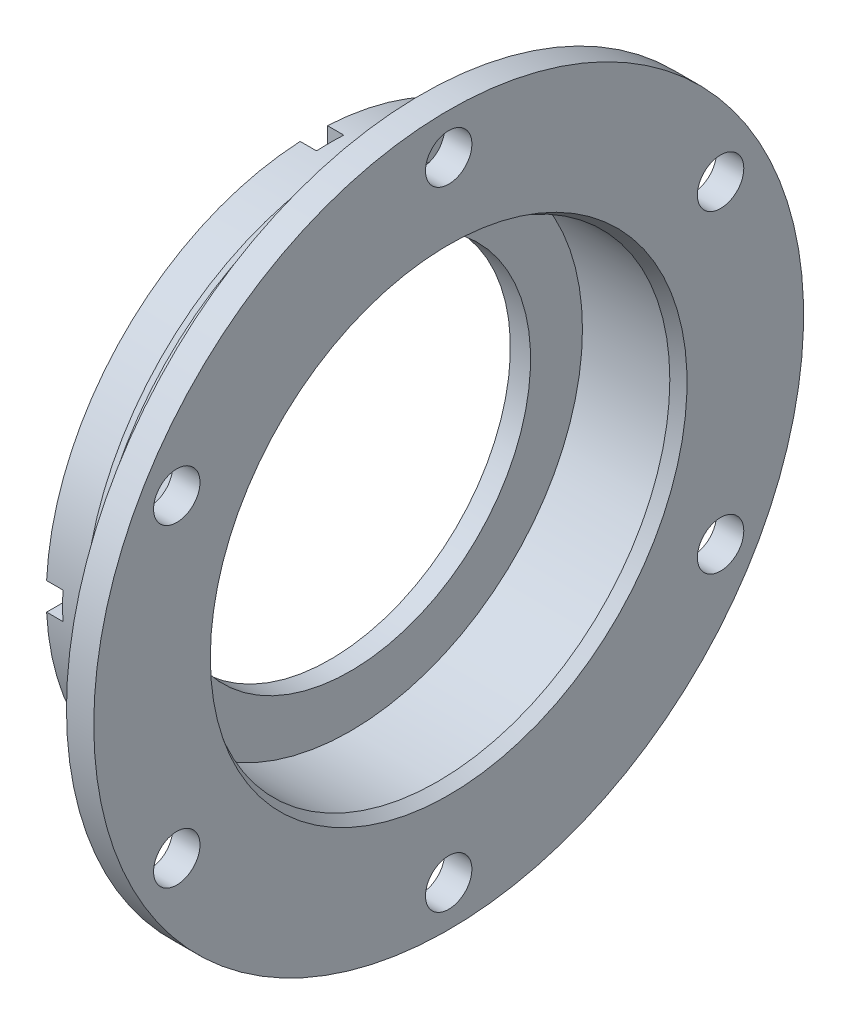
ISO-10303-21;
HEADER;
FILE_DESCRIPTION(('STEP AP214'),'2;1');
FILE_NAME('part.step','',(''),(''),'','','');
FILE_SCHEMA(('AUTOMOTIVE_DESIGN { 1 0 10303 214 1 1 1 1 }'));
ENDSEC;
DATA;
#1=APPLICATION_CONTEXT('core data for automotive mechanical design processes');
#2=APPLICATION_PROTOCOL_DEFINITION('international standard','automotive_design',2000,#1);
#3=PRODUCT_CONTEXT('',#1,'mechanical');
#4=PRODUCT('Part','Part','',(#3));
#5=PRODUCT_RELATED_PRODUCT_CATEGORY('part','',(#4));
#6=PRODUCT_DEFINITION_FORMATION('','',#4);
#7=PRODUCT_DEFINITION_CONTEXT('part definition',#1,'design');
#8=PRODUCT_DEFINITION('design','',#6,#7);
#9=PRODUCT_DEFINITION_SHAPE('','',#8);
#10=(LENGTH_UNIT() NAMED_UNIT(*) SI_UNIT(.MILLI.,.METRE.));
#11=(NAMED_UNIT(*) PLANE_ANGLE_UNIT() SI_UNIT($,.RADIAN.));
#12=(NAMED_UNIT(*) SI_UNIT($,.STERADIAN.) SOLID_ANGLE_UNIT());
#13=UNCERTAINTY_MEASURE_WITH_UNIT(LENGTH_MEASURE(1.E-05),#10,'distance_accuracy_value','');
#14=(GEOMETRIC_REPRESENTATION_CONTEXT(3) GLOBAL_UNCERTAINTY_ASSIGNED_CONTEXT((#13)) GLOBAL_UNIT_ASSIGNED_CONTEXT((#10,
#11,#12)) REPRESENTATION_CONTEXT('',''));
#15=CARTESIAN_POINT('',(0.,0.,0.));
#16=DIRECTION('',(0.,0.,1.));
#17=DIRECTION('',(1.,0.,0.));
#18=AXIS2_PLACEMENT_3D('',#15,#16,#17);
#19=CARTESIAN_POINT('',(-14.8847324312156,0.,0.));
#20=DIRECTION('',(-1.,0.,0.));
#21=DIRECTION('',(0.,0.,1.));
#22=AXIS2_PLACEMENT_3D('',#19,#20,#21);
#23=CYLINDRICAL_SURFACE('',#22,50.);
#24=CARTESIAN_POINT('',(8.7,0.,0.));
#25=DIRECTION('',(-1.,0.,0.));
#26=DIRECTION('',(0.,0.,1.));
#27=AXIS2_PLACEMENT_3D('',#24,#25,#26);
#28=CIRCLE('',#27,50.);
#29=CARTESIAN_POINT('',(8.7,0.,50.));
#30=VERTEX_POINT('',#29);
#31=EDGE_CURVE('E848',#30,#30,#28,.T.);
#32=ORIENTED_EDGE('',*,*,#31,.F.);
#33=EDGE_LOOP('',(#32));
#34=FACE_BOUND('',#33,.T.);
#35=CARTESIAN_POINT('',(10.6,0.,0.));
#36=DIRECTION('',(-1.,0.,0.));
#37=DIRECTION('',(0.,0.,1.));
#38=AXIS2_PLACEMENT_3D('',#35,#36,#37);
#39=CIRCLE('',#38,50.);
#40=CARTESIAN_POINT('',(10.6,0.,50.));
#41=VERTEX_POINT('',#40);
#42=EDGE_CURVE('E722',#41,#41,#39,.T.);
#43=ORIENTED_EDGE('',*,*,#42,.T.);
#44=EDGE_LOOP('',(#43));
#45=FACE_BOUND('',#44,.T.);
#46=ADVANCED_FACE('F453',(#34,#45),#23,.T.);
#47=CARTESIAN_POINT('',(19.7,0.,0.));
#48=DIRECTION('',(-1.,0.,0.));
#49=DIRECTION('',(0.,0.,1.));
#50=AXIS2_PLACEMENT_3D('',#47,#48,#49);
#51=CIRCLE('',#50,50.);
#52=CARTESIAN_POINT('',(19.7,0.,50.));
#53=VERTEX_POINT('',#52);
#54=EDGE_CURVE('E845',#53,#53,#51,.T.);
#55=ORIENTED_EDGE('',*,*,#54,.T.);
#56=EDGE_LOOP('',(#55));
#57=FACE_BOUND('',#56,.T.);
#58=CARTESIAN_POINT('',(17.7,0.,0.));
#59=DIRECTION('',(-1.,0.,0.));
#60=DIRECTION('',(0.,0.,1.));
#61=AXIS2_PLACEMENT_3D('',#58,#59,#60);
#62=CIRCLE('',#61,50.);
#63=CARTESIAN_POINT('',(17.7,0.,50.));
#64=VERTEX_POINT('',#63);
#65=EDGE_CURVE('E719',#64,#64,#62,.T.);
#66=ORIENTED_EDGE('',*,*,#65,.F.);
#67=EDGE_LOOP('',(#66));
#68=FACE_BOUND('',#67,.T.);
#69=ADVANCED_FACE('F743',(#57,#68),#23,.T.);
#70=CARTESIAN_POINT('',(-14.8847324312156,0.,0.));
#71=DIRECTION('',(-1.,0.,0.));
#72=DIRECTION('',(0.,0.,1.));
#73=AXIS2_PLACEMENT_3D('',#70,#71,#72);
#74=CYLINDRICAL_SURFACE('',#73,45.);
#75=CARTESIAN_POINT('',(0.,0.,0.));
#76=DIRECTION('',(-1.,0.,0.));
#77=DIRECTION('',(0.,0.,1.));
#78=AXIS2_PLACEMENT_3D('',#75,#76,#77);
#79=CIRCLE('',#78,45.);
#80=CARTESIAN_POINT('',(0.,44.9305018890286,-2.5));
#81=VERTEX_POINT('',#80);
#82=CARTESIAN_POINT('',(0.,2.50000000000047,-44.9305018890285));
#83=VERTEX_POINT('',#82);
#84=EDGE_CURVE('E583',#81,#83,#79,.T.);
#85=ORIENTED_EDGE('',*,*,#84,.T.);
#86=DIRECTION('',(-1.,0.,0.));
#87=VECTOR('',#86,1.);
#88=CARTESIAN_POINT('',(9.44676778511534,2.50000000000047,-44.9305018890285));
#89=LINE('',#88,#87);
#90=CARTESIAN_POINT('',(3.,2.50000000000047,-44.9305018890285));
#91=VERTEX_POINT('',#90);
#92=EDGE_CURVE('E569',#91,#83,#89,.T.);
#93=ORIENTED_EDGE('',*,*,#92,.F.);
#94=CARTESIAN_POINT('',(3.,0.,0.));
#95=DIRECTION('',(-1.,0.,0.));
#96=DIRECTION('',(0.,0.,1.));
#97=AXIS2_PLACEMENT_3D('',#94,#95,#96);
#98=CIRCLE('',#97,45.);
#99=CARTESIAN_POINT('',(3.,44.9305018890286,-2.5));
#100=VERTEX_POINT('',#99);
#101=EDGE_CURVE('E581',#100,#91,#98,.T.);
#102=ORIENTED_EDGE('',*,*,#101,.F.);
#103=DIRECTION('',(-1.,0.,0.));
#104=VECTOR('',#103,1.);
#105=CARTESIAN_POINT('',(9.44676778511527,44.9305018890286,-2.5));
#106=LINE('',#105,#104);
#107=EDGE_CURVE('E616',#100,#81,#106,.T.);
#108=ORIENTED_EDGE('',*,*,#107,.T.);
#109=EDGE_LOOP('',(#85,#93,#102,#108));
#110=FACE_BOUND('',#109,.T.);
#111=ADVANCED_FACE('F579',(#110),#74,.F.);
#112=CARTESIAN_POINT('',(0.,45.,0.));
#113=DIRECTION('',(1.,0.,0.));
#114=DIRECTION('',(0.,0.,-1.));
#115=AXIS2_PLACEMENT_3D('',#112,#113,#114);
#116=PLANE('',#115);
#117=CARTESIAN_POINT('',(0.,0.,0.));
#118=DIRECTION('',(-1.,0.,0.));
#119=DIRECTION('',(0.,0.,1.));
#120=AXIS2_PLACEMENT_3D('',#117,#118,#119);
#121=CIRCLE('',#120,49.);
#122=CARTESIAN_POINT('',(0.,48.9361829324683,-2.5));
#123=VERTEX_POINT('',#122);
#124=CARTESIAN_POINT('',(0.,2.50000000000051,-48.9361829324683));
#125=VERTEX_POINT('',#124);
#126=EDGE_CURVE('E801',#123,#125,#121,.T.);
#127=ORIENTED_EDGE('',*,*,#126,.T.);
#128=DIRECTION('',(0.,0.,-1.));
#129=VECTOR('',#128,1.);
#130=CARTESIAN_POINT('',(0.,2.50000000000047,-44.9305018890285));
#131=LINE('',#130,#129);
#132=EDGE_CURVE('E584',#83,#125,#131,.T.);
#133=ORIENTED_EDGE('',*,*,#132,.F.);
#134=ORIENTED_EDGE('',*,*,#84,.F.);
#135=DIRECTION('',(0.,-1.,0.));
#136=VECTOR('',#135,1.);
#137=CARTESIAN_POINT('',(0.,44.9305018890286,-2.5));
#138=LINE('',#137,#136);
#139=EDGE_CURVE('E625',#123,#81,#138,.T.);
#140=ORIENTED_EDGE('',*,*,#139,.F.);
#141=EDGE_LOOP('',(#127,#133,#134,#140));
#142=FACE_BOUND('',#141,.T.);
#143=ADVANCED_FACE('F764',(#142),#116,.F.);
#144=CARTESIAN_POINT('',(3.,-2.49999999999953,-44.9305018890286));
#145=VERTEX_POINT('',#144);
#146=CARTESIAN_POINT('',(3.,-44.9305018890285,-2.50000000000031));
#147=VERTEX_POINT('',#146);
#148=EDGE_CURVE('E591',#145,#147,#98,.T.);
#149=ORIENTED_EDGE('',*,*,#148,.F.);
#150=DIRECTION('',(-1.,0.,0.));
#151=VECTOR('',#150,1.);
#152=CARTESIAN_POINT('',(9.44676778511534,-2.49999999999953,-44.9305018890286));
#153=LINE('',#152,#151);
#154=CARTESIAN_POINT('',(0.,-2.49999999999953,-44.9305018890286));
#155=VERTEX_POINT('',#154);
#156=EDGE_CURVE('E706',#145,#155,#153,.T.);
#157=ORIENTED_EDGE('',*,*,#156,.T.);
#158=CARTESIAN_POINT('',(0.,-44.9305018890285,-2.50000000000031));
#159=VERTEX_POINT('',#158);
#160=EDGE_CURVE('E792',#155,#159,#79,.T.);
#161=ORIENTED_EDGE('',*,*,#160,.T.);
#162=DIRECTION('',(-1.,0.,0.));
#163=VECTOR('',#162,1.);
#164=CARTESIAN_POINT('',(9.44676778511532,-44.9305018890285,-2.50000000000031));
#165=LINE('',#164,#163);
#166=EDGE_CURVE('E690',#147,#159,#165,.T.);
#167=ORIENTED_EDGE('',*,*,#166,.F.);
#168=EDGE_LOOP('',(#149,#157,#161,#167));
#169=FACE_BOUND('',#168,.T.);
#170=ADVANCED_FACE('F773',(#169),#74,.F.);
#171=ORIENTED_EDGE('',*,*,#160,.F.);
#172=DIRECTION('',(0.,0.,1.));
#173=VECTOR('',#172,1.);
#174=CARTESIAN_POINT('',(0.,-2.49999999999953,-44.9305018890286));
#175=LINE('',#174,#173);
#176=CARTESIAN_POINT('',(0.,-2.49999999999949,-48.9361829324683));
#177=VERTEX_POINT('',#176);
#178=EDGE_CURVE('E710',#177,#155,#175,.T.);
#179=ORIENTED_EDGE('',*,*,#178,.F.);
#180=CARTESIAN_POINT('',(0.,-48.9361829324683,-2.50000000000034));
#181=VERTEX_POINT('',#180);
#182=EDGE_CURVE('E859',#177,#181,#121,.T.);
#183=ORIENTED_EDGE('',*,*,#182,.T.);
#184=DIRECTION('',(0.,-1.,0.));
#185=VECTOR('',#184,1.);
#186=CARTESIAN_POINT('',(0.,-44.9305018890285,-2.50000000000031));
#187=LINE('',#186,#185);
#188=EDGE_CURVE('E694',#159,#181,#187,.T.);
#189=ORIENTED_EDGE('',*,*,#188,.F.);
#190=EDGE_LOOP('',(#171,#179,#183,#189));
#191=FACE_BOUND('',#190,.T.);
#192=ADVANCED_FACE('F775',(#191),#116,.F.);
#193=CARTESIAN_POINT('',(3.,-44.9305018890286,2.49999999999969));
#194=VERTEX_POINT('',#193);
#195=CARTESIAN_POINT('',(3.,-2.50000000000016,44.9305018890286));
#196=VERTEX_POINT('',#195);
#197=EDGE_CURVE('E597',#194,#196,#98,.T.);
#198=ORIENTED_EDGE('',*,*,#197,.F.);
#199=DIRECTION('',(-1.,0.,0.));
#200=VECTOR('',#199,1.);
#201=CARTESIAN_POINT('',(9.44676778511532,-44.9305018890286,2.49999999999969));
#202=LINE('',#201,#200);
#203=CARTESIAN_POINT('',(0.,-44.9305018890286,2.49999999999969));
#204=VERTEX_POINT('',#203);
#205=EDGE_CURVE('E687',#194,#204,#202,.T.);
#206=ORIENTED_EDGE('',*,*,#205,.T.);
#207=CARTESIAN_POINT('',(0.,-2.50000000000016,44.9305018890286));
#208=VERTEX_POINT('',#207);
#209=EDGE_CURVE('E795',#204,#208,#79,.T.);
#210=ORIENTED_EDGE('',*,*,#209,.T.);
#211=DIRECTION('',(-1.,0.,0.));
#212=VECTOR('',#211,1.);
#213=CARTESIAN_POINT('',(9.44676778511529,-2.50000000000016,44.9305018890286));
#214=LINE('',#213,#212);
#215=EDGE_CURVE('E669',#196,#208,#214,.T.);
#216=ORIENTED_EDGE('',*,*,#215,.F.);
#217=EDGE_LOOP('',(#198,#206,#210,#216));
#218=FACE_BOUND('',#217,.T.);
#219=ADVANCED_FACE('F770',(#218),#74,.F.);
#220=ORIENTED_EDGE('',*,*,#209,.F.);
#221=DIRECTION('',(0.,1.,0.));
#222=VECTOR('',#221,1.);
#223=CARTESIAN_POINT('',(0.,-44.9305018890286,2.49999999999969));
#224=LINE('',#223,#222);
#225=CARTESIAN_POINT('',(0.,-48.9361829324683,2.49999999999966));
#226=VERTEX_POINT('',#225);
#227=EDGE_CURVE('E698',#226,#204,#224,.T.);
#228=ORIENTED_EDGE('',*,*,#227,.F.);
#229=CARTESIAN_POINT('',(0.,-2.50000000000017,48.9361829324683));
#230=VERTEX_POINT('',#229);
#231=EDGE_CURVE('E855',#226,#230,#121,.T.);
#232=ORIENTED_EDGE('',*,*,#231,.T.);
#233=DIRECTION('',(0.,0.,1.));
#234=VECTOR('',#233,1.);
#235=CARTESIAN_POINT('',(0.,-2.50000000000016,44.9305018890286));
#236=LINE('',#235,#234);
#237=EDGE_CURVE('E673',#208,#230,#236,.T.);
#238=ORIENTED_EDGE('',*,*,#237,.F.);
#239=EDGE_LOOP('',(#220,#228,#232,#238));
#240=FACE_BOUND('',#239,.T.);
#241=ADVANCED_FACE('F765',(#240),#116,.F.);
#242=CARTESIAN_POINT('',(3.,2.49999999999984,44.9305018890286));
#243=VERTEX_POINT('',#242);
#244=CARTESIAN_POINT('',(3.,44.9305018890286,2.5));
#245=VERTEX_POINT('',#244);
#246=EDGE_CURVE('E593',#243,#245,#98,.T.);
#247=ORIENTED_EDGE('',*,*,#246,.F.);
#248=DIRECTION('',(-1.,0.,0.));
#249=VECTOR('',#248,1.);
#250=CARTESIAN_POINT('',(9.44676778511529,2.49999999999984,44.9305018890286));
#251=LINE('',#250,#249);
#252=CARTESIAN_POINT('',(0.,2.49999999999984,44.9305018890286));
#253=VERTEX_POINT('',#252);
#254=EDGE_CURVE('E665',#243,#253,#251,.T.);
#255=ORIENTED_EDGE('',*,*,#254,.T.);
#256=CARTESIAN_POINT('',(0.,44.9305018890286,2.5));
#257=VERTEX_POINT('',#256);
#258=EDGE_CURVE('E798',#253,#257,#79,.T.);
#259=ORIENTED_EDGE('',*,*,#258,.T.);
#260=DIRECTION('',(-1.,0.,0.));
#261=VECTOR('',#260,1.);
#262=CARTESIAN_POINT('',(9.44676778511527,44.9305018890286,2.5));
#263=LINE('',#262,#261);
#264=EDGE_CURVE('E618',#245,#257,#263,.T.);
#265=ORIENTED_EDGE('',*,*,#264,.F.);
#266=EDGE_LOOP('',(#247,#255,#259,#265));
#267=FACE_BOUND('',#266,.T.);
#268=ADVANCED_FACE('F455',(#267),#74,.F.);
#269=ORIENTED_EDGE('',*,*,#258,.F.);
#270=DIRECTION('',(0.,0.,-1.));
#271=VECTOR('',#270,1.);
#272=CARTESIAN_POINT('',(0.,2.49999999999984,44.9305018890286));
#273=LINE('',#272,#271);
#274=CARTESIAN_POINT('',(0.,2.49999999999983,48.9361829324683));
#275=VERTEX_POINT('',#274);
#276=EDGE_CURVE('E677',#275,#253,#273,.T.);
#277=ORIENTED_EDGE('',*,*,#276,.F.);
#278=CARTESIAN_POINT('',(0.,48.9361829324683,2.5));
#279=VERTEX_POINT('',#278);
#280=EDGE_CURVE('E852',#275,#279,#121,.T.);
#281=ORIENTED_EDGE('',*,*,#280,.T.);
#282=DIRECTION('',(0.,1.,0.));
#283=VECTOR('',#282,1.);
#284=CARTESIAN_POINT('',(0.,44.9305018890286,2.5));
#285=LINE('',#284,#283);
#286=EDGE_CURVE('E622',#257,#279,#285,.T.);
#287=ORIENTED_EDGE('',*,*,#286,.F.);
#288=EDGE_LOOP('',(#269,#277,#281,#287));
#289=FACE_BOUND('',#288,.T.);
#290=ADVANCED_FACE('F760',(#289),#116,.F.);
#291=CARTESIAN_POINT('',(-14.8847324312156,0.,0.));
#292=DIRECTION('',(-1.,0.,0.));
#293=DIRECTION('',(0.,0.,1.));
#294=AXIS2_PLACEMENT_3D('',#291,#292,#293);
#295=CYLINDRICAL_SURFACE('',#294,49.);
#296=CARTESIAN_POINT('',(3.,0.,0.));
#297=DIRECTION('',(1.,0.,0.));
#298=DIRECTION('',(0.,0.,-1.));
#299=AXIS2_PLACEMENT_3D('',#296,#297,#298);
#300=CIRCLE('',#299,49.);
#301=CARTESIAN_POINT('',(3.,-2.49999999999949,-48.9361829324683));
#302=VERTEX_POINT('',#301);
#303=CARTESIAN_POINT('',(3.,2.50000000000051,-48.9361829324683));
#304=VERTEX_POINT('',#303);
#305=EDGE_CURVE('E808',#302,#304,#300,.T.);
#306=ORIENTED_EDGE('',*,*,#305,.T.);
#307=DIRECTION('',(-1.,0.,0.));
#308=VECTOR('',#307,1.);
#309=CARTESIAN_POINT('',(-14.8847324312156,2.50000000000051,-48.9361829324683));
#310=LINE('',#309,#308);
#311=EDGE_CURVE('E572',#304,#125,#310,.T.);
#312=ORIENTED_EDGE('',*,*,#311,.T.);
#313=ORIENTED_EDGE('',*,*,#126,.F.);
#314=DIRECTION('',(-1.,0.,0.));
#315=VECTOR('',#314,1.);
#316=CARTESIAN_POINT('',(-14.8847324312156,48.9361829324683,-2.5));
#317=LINE('',#316,#315);
#318=CARTESIAN_POINT('',(3.,48.9361829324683,-2.5));
#319=VERTEX_POINT('',#318);
#320=EDGE_CURVE('E613',#123,#319,#317,.F.);
#321=ORIENTED_EDGE('',*,*,#320,.T.);
#322=CARTESIAN_POINT('',(3.,0.,0.));
#323=DIRECTION('',(1.,0.,0.));
#324=DIRECTION('',(0.,0.,-1.));
#325=AXIS2_PLACEMENT_3D('',#322,#323,#324);
#326=CIRCLE('',#325,49.);
#327=CARTESIAN_POINT('',(3.,48.9361829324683,2.5));
#328=VERTEX_POINT('',#327);
#329=EDGE_CURVE('E797',#319,#328,#326,.T.);
#330=ORIENTED_EDGE('',*,*,#329,.T.);
#331=DIRECTION('',(-1.,0.,0.));
#332=VECTOR('',#331,1.);
#333=CARTESIAN_POINT('',(-14.8847324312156,48.9361829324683,2.5));
#334=LINE('',#333,#332);
#335=EDGE_CURVE('E608',#328,#279,#334,.T.);
#336=ORIENTED_EDGE('',*,*,#335,.T.);
#337=ORIENTED_EDGE('',*,*,#280,.F.);
#338=DIRECTION('',(-1.,0.,0.));
#339=VECTOR('',#338,1.);
#340=CARTESIAN_POINT('',(-14.8847324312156,2.49999999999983,48.9361829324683));
#341=LINE('',#340,#339);
#342=CARTESIAN_POINT('',(3.,2.49999999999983,48.9361829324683));
#343=VERTEX_POINT('',#342);
#344=EDGE_CURVE('E662',#275,#343,#341,.F.);
#345=ORIENTED_EDGE('',*,*,#344,.T.);
#346=CARTESIAN_POINT('',(3.,0.,0.));
#347=DIRECTION('',(1.,0.,0.));
#348=DIRECTION('',(0.,0.,-1.));
#349=AXIS2_PLACEMENT_3D('',#346,#347,#348);
#350=CIRCLE('',#349,49.);
#351=CARTESIAN_POINT('',(3.,-2.50000000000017,48.9361829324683));
#352=VERTEX_POINT('',#351);
#353=EDGE_CURVE('E804',#343,#352,#350,.T.);
#354=ORIENTED_EDGE('',*,*,#353,.T.);
#355=DIRECTION('',(-1.,0.,0.));
#356=VECTOR('',#355,1.);
#357=CARTESIAN_POINT('',(-14.8847324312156,-2.50000000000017,48.9361829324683));
#358=LINE('',#357,#356);
#359=EDGE_CURVE('E659',#352,#230,#358,.T.);
#360=ORIENTED_EDGE('',*,*,#359,.T.);
#361=ORIENTED_EDGE('',*,*,#231,.F.);
#362=DIRECTION('',(-1.,0.,0.));
#363=VECTOR('',#362,1.);
#364=CARTESIAN_POINT('',(-14.8847324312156,-48.9361829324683,2.49999999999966));
#365=LINE('',#364,#363);
#366=CARTESIAN_POINT('',(3.,-48.9361829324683,2.49999999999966));
#367=VERTEX_POINT('',#366);
#368=EDGE_CURVE('E684',#226,#367,#365,.F.);
#369=ORIENTED_EDGE('',*,*,#368,.T.);
#370=CARTESIAN_POINT('',(3.,0.,0.));
#371=DIRECTION('',(1.,0.,0.));
#372=DIRECTION('',(0.,0.,-1.));
#373=AXIS2_PLACEMENT_3D('',#370,#371,#372);
#374=CIRCLE('',#373,49.);
#375=CARTESIAN_POINT('',(3.,-48.9361829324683,-2.50000000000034));
#376=VERTEX_POINT('',#375);
#377=EDGE_CURVE('E806',#367,#376,#374,.T.);
#378=ORIENTED_EDGE('',*,*,#377,.T.);
#379=DIRECTION('',(-1.,0.,0.));
#380=VECTOR('',#379,1.);
#381=CARTESIAN_POINT('',(-14.8847324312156,-48.9361829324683,-2.50000000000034));
#382=LINE('',#381,#380);
#383=EDGE_CURVE('E679',#376,#181,#382,.T.);
#384=ORIENTED_EDGE('',*,*,#383,.T.);
#385=ORIENTED_EDGE('',*,*,#182,.F.);
#386=DIRECTION('',(-1.,0.,0.));
#387=VECTOR('',#386,1.);
#388=CARTESIAN_POINT('',(-14.8847324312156,-2.49999999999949,-48.9361829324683));
#389=LINE('',#388,#387);
#390=EDGE_CURVE('E703',#177,#302,#389,.F.);
#391=ORIENTED_EDGE('',*,*,#390,.T.);
#392=EDGE_LOOP('',(#306,#312,#313,#321,#330,#336,#337,#345,#354,#360,#361,#369,#378,#384,#385,#391));
#393=FACE_BOUND('',#392,.T.);
#394=CARTESIAN_POINT('',(6.9679491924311,0.,0.));
#395=DIRECTION('',(-1.,0.,0.));
#396=DIRECTION('',(0.,0.,1.));
#397=AXIS2_PLACEMENT_3D('',#394,#395,#396);
#398=CIRCLE('',#397,49.);
#399=CARTESIAN_POINT('',(6.9679491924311,0.,49.));
#400=VERTEX_POINT('',#399);
#401=EDGE_CURVE('E850',#400,#400,#398,.T.);
#402=ORIENTED_EDGE('',*,*,#401,.T.);
#403=EDGE_LOOP('',(#402));
#404=FACE_BOUND('',#403,.T.);
#405=ADVANCED_FACE('F757',(#393,#404),#295,.T.);
#406=CARTESIAN_POINT('',(8.7,0.,0.));
#407=DIRECTION('',(1.,0.,0.));
#408=DIRECTION('',(0.,0.,-1.));
#409=AXIS2_PLACEMENT_3D('',#406,#407,#408);
#410=CONICAL_SURFACE('',#409,50.,0.523598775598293);
#411=ORIENTED_EDGE('',*,*,#401,.F.);
#412=EDGE_LOOP('',(#411));
#413=FACE_BOUND('',#412,.T.);
#414=ORIENTED_EDGE('',*,*,#31,.T.);
#415=EDGE_LOOP('',(#414));
#416=FACE_BOUND('',#415,.T.);
#417=ADVANCED_FACE('F754',(#413,#416),#410,.T.);
#418=CARTESIAN_POINT('',(19.7,50.,0.));
#419=DIRECTION('',(1.,0.,0.));
#420=DIRECTION('',(0.,0.,-1.));
#421=AXIS2_PLACEMENT_3D('',#418,#419,#420);
#422=PLANE('',#421);
#423=CARTESIAN_POINT('',(19.7,28.7500000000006,-49.7964607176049));
#424=DIRECTION('',(1.,0.,0.));
#425=DIRECTION('',(0.,0.,-1.));
#426=AXIS2_PLACEMENT_3D('',#423,#424,#425);
#427=CIRCLE('',#426,4.24999999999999);
#428=CARTESIAN_POINT('',(19.7,28.7500000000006,-54.0464607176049));
#429=VERTEX_POINT('',#428);
#430=EDGE_CURVE('E653',#429,#429,#427,.T.);
#431=ORIENTED_EDGE('',*,*,#430,.T.);
#432=EDGE_LOOP('',(#431));
#433=FACE_BOUND('',#432,.T.);
#434=CARTESIAN_POINT('',(19.7,-28.7499999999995,-49.7964607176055));
#435=DIRECTION('',(1.,0.,0.));
#436=DIRECTION('',(0.,0.,-1.));
#437=AXIS2_PLACEMENT_3D('',#434,#435,#436);
#438=CIRCLE('',#437,4.24999999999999);
#439=CARTESIAN_POINT('',(19.7,-28.7499999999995,-54.0464607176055));
#440=VERTEX_POINT('',#439);
#441=EDGE_CURVE('E647',#440,#440,#438,.T.);
#442=ORIENTED_EDGE('',*,*,#441,.T.);
#443=EDGE_LOOP('',(#442));
#444=FACE_BOUND('',#443,.T.);
#445=CARTESIAN_POINT('',(19.7,-57.5,-4.01520586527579E-13));
#446=DIRECTION('',(1.,0.,0.));
#447=DIRECTION('',(0.,0.,-1.));
#448=AXIS2_PLACEMENT_3D('',#445,#446,#447);
#449=CIRCLE('',#448,4.24999999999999);
#450=CARTESIAN_POINT('',(19.7,-57.5,-4.2500000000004));
#451=VERTEX_POINT('',#450);
#452=EDGE_CURVE('E641',#451,#451,#449,.T.);
#453=ORIENTED_EDGE('',*,*,#452,.T.);
#454=EDGE_LOOP('',(#453));
#455=FACE_BOUND('',#454,.T.);
#456=CARTESIAN_POINT('',(19.7,-28.7500000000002,49.7964607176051));
#457=DIRECTION('',(1.,0.,0.));
#458=DIRECTION('',(0.,0.,-1.));
#459=AXIS2_PLACEMENT_3D('',#456,#457,#458);
#460=CIRCLE('',#459,4.24999999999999);
#461=CARTESIAN_POINT('',(19.7,-28.7500000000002,45.5464607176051));
#462=VERTEX_POINT('',#461);
#463=EDGE_CURVE('E635',#462,#462,#460,.T.);
#464=ORIENTED_EDGE('',*,*,#463,.T.);
#465=EDGE_LOOP('',(#464));
#466=FACE_BOUND('',#465,.T.);
#467=CARTESIAN_POINT('',(19.7,28.7499999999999,49.7964607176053));
#468=DIRECTION('',(1.,0.,0.));
#469=DIRECTION('',(0.,0.,-1.));
#470=AXIS2_PLACEMENT_3D('',#467,#468,#469);
#471=CIRCLE('',#470,4.24999999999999);
#472=CARTESIAN_POINT('',(19.7,28.7499999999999,45.5464607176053));
#473=VERTEX_POINT('',#472);
#474=EDGE_CURVE('E627',#473,#473,#471,.T.);
#475=ORIENTED_EDGE('',*,*,#474,.T.);
#476=EDGE_LOOP('',(#475));
#477=FACE_BOUND('',#476,.T.);
#478=CARTESIAN_POINT('',(19.7,57.5,0.));
#479=DIRECTION('',(1.,0.,0.));
#480=DIRECTION('',(0.,0.,-1.));
#481=AXIS2_PLACEMENT_3D('',#478,#479,#480);
#482=CIRCLE('',#481,4.24999999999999);
#483=CARTESIAN_POINT('',(19.7,57.5,-4.24999999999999));
#484=VERTEX_POINT('',#483);
#485=EDGE_CURVE('E599',#484,#484,#482,.T.);
#486=ORIENTED_EDGE('',*,*,#485,.T.);
#487=EDGE_LOOP('',(#486));
#488=FACE_BOUND('',#487,.T.);
#489=ORIENTED_EDGE('',*,*,#54,.F.);
#490=EDGE_LOOP('',(#489));
#491=FACE_BOUND('',#490,.T.);
#492=CARTESIAN_POINT('',(19.7,0.,0.));
#493=DIRECTION('',(-1.,0.,0.));
#494=DIRECTION('',(0.,0.,1.));
#495=AXIS2_PLACEMENT_3D('',#492,#493,#494);
#496=CIRCLE('',#495,65.);
#497=CARTESIAN_POINT('',(19.7,0.,65.));
#498=VERTEX_POINT('',#497);
#499=EDGE_CURVE('E838',#498,#498,#496,.T.);
#500=ORIENTED_EDGE('',*,*,#499,.T.);
#501=EDGE_LOOP('',(#500));
#502=FACE_BOUND('',#501,.T.);
#503=ADVANCED_FACE('F752',(#433,#444,#455,#466,#477,#488,#491,#502),#422,.F.);
#504=CARTESIAN_POINT('',(-14.8847324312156,0.,0.));
#505=DIRECTION('',(-1.,0.,0.));
#506=DIRECTION('',(0.,0.,1.));
#507=AXIS2_PLACEMENT_3D('',#504,#505,#506);
#508=CYLINDRICAL_SURFACE('',#507,65.);
#509=ORIENTED_EDGE('',*,*,#499,.F.);
#510=EDGE_LOOP('',(#509));
#511=FACE_BOUND('',#510,.T.);
#512=CARTESIAN_POINT('',(24.7,0.,0.));
#513=DIRECTION('',(-1.,0.,0.));
#514=DIRECTION('',(0.,0.,1.));
#515=AXIS2_PLACEMENT_3D('',#512,#513,#514);
#516=CIRCLE('',#515,65.);
#517=CARTESIAN_POINT('',(24.7,0.,65.));
#518=VERTEX_POINT('',#517);
#519=EDGE_CURVE('E835',#518,#518,#516,.T.);
#520=ORIENTED_EDGE('',*,*,#519,.T.);
#521=EDGE_LOOP('',(#520));
#522=FACE_BOUND('',#521,.T.);
#523=ADVANCED_FACE('F939',(#511,#522),#508,.T.);
#524=CARTESIAN_POINT('',(24.7,65.,0.));
#525=DIRECTION('',(-1.,0.,0.));
#526=DIRECTION('',(0.,0.,1.));
#527=AXIS2_PLACEMENT_3D('',#524,#525,#526);
#528=PLANE('',#527);
#529=CARTESIAN_POINT('',(24.7,0.,0.));
#530=DIRECTION('',(-1.,0.,0.));
#531=DIRECTION('',(0.,0.,1.));
#532=AXIS2_PLACEMENT_3D('',#529,#530,#531);
#533=CIRCLE('',#532,43.6547005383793);
#534=CARTESIAN_POINT('',(24.7,0.,43.6547005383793));
#535=VERTEX_POINT('',#534);
#536=EDGE_CURVE('E461',#535,#535,#533,.T.);
#537=ORIENTED_EDGE('',*,*,#536,.T.);
#538=EDGE_LOOP('',(#537));
#539=FACE_BOUND('',#538,.T.);
#540=CARTESIAN_POINT('',(24.7,28.7500000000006,-49.7964607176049));
#541=DIRECTION('',(1.,0.,0.));
#542=DIRECTION('',(0.,0.,-1.));
#543=AXIS2_PLACEMENT_3D('',#540,#541,#542);
#544=CIRCLE('',#543,4.24999999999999);
#545=CARTESIAN_POINT('',(24.7,28.7500000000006,-54.0464607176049));
#546=VERTEX_POINT('',#545);
#547=EDGE_CURVE('E656',#546,#546,#544,.T.);
#548=ORIENTED_EDGE('',*,*,#547,.F.);
#549=EDGE_LOOP('',(#548));
#550=FACE_BOUND('',#549,.T.);
#551=CARTESIAN_POINT('',(24.7,-28.7499999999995,-49.7964607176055));
#552=DIRECTION('',(1.,0.,0.));
#553=DIRECTION('',(0.,0.,-1.));
#554=AXIS2_PLACEMENT_3D('',#551,#552,#553);
#555=CIRCLE('',#554,4.24999999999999);
#556=CARTESIAN_POINT('',(24.7,-28.7499999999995,-54.0464607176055));
#557=VERTEX_POINT('',#556);
#558=EDGE_CURVE('E650',#557,#557,#555,.T.);
#559=ORIENTED_EDGE('',*,*,#558,.F.);
#560=EDGE_LOOP('',(#559));
#561=FACE_BOUND('',#560,.T.);
#562=CARTESIAN_POINT('',(24.7,-57.5,-4.01520586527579E-13));
#563=DIRECTION('',(1.,0.,0.));
#564=DIRECTION('',(0.,0.,-1.));
#565=AXIS2_PLACEMENT_3D('',#562,#563,#564);
#566=CIRCLE('',#565,4.24999999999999);
#567=CARTESIAN_POINT('',(24.7,-57.5,-4.25000000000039));
#568=VERTEX_POINT('',#567);
#569=EDGE_CURVE('E644',#568,#568,#566,.T.);
#570=ORIENTED_EDGE('',*,*,#569,.F.);
#571=EDGE_LOOP('',(#570));
#572=FACE_BOUND('',#571,.T.);
#573=CARTESIAN_POINT('',(24.7,-28.7500000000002,49.7964607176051));
#574=DIRECTION('',(1.,0.,0.));
#575=DIRECTION('',(0.,0.,-1.));
#576=AXIS2_PLACEMENT_3D('',#573,#574,#575);
#577=CIRCLE('',#576,4.24999999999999);
#578=CARTESIAN_POINT('',(24.7,-28.7500000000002,45.5464607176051));
#579=VERTEX_POINT('',#578);
#580=EDGE_CURVE('E638',#579,#579,#577,.T.);
#581=ORIENTED_EDGE('',*,*,#580,.F.);
#582=EDGE_LOOP('',(#581));
#583=FACE_BOUND('',#582,.T.);
#584=CARTESIAN_POINT('',(24.7,28.7499999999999,49.7964607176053));
#585=DIRECTION('',(1.,0.,0.));
#586=DIRECTION('',(0.,0.,-1.));
#587=AXIS2_PLACEMENT_3D('',#584,#585,#586);
#588=CIRCLE('',#587,4.24999999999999);
#589=CARTESIAN_POINT('',(24.7,28.7499999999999,45.5464607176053));
#590=VERTEX_POINT('',#589);
#591=EDGE_CURVE('E632',#590,#590,#588,.T.);
#592=ORIENTED_EDGE('',*,*,#591,.F.);
#593=EDGE_LOOP('',(#592));
#594=FACE_BOUND('',#593,.T.);
#595=CARTESIAN_POINT('',(24.7,57.5,0.));
#596=DIRECTION('',(1.,0.,0.));
#597=DIRECTION('',(0.,0.,-1.));
#598=AXIS2_PLACEMENT_3D('',#595,#596,#597);
#599=CIRCLE('',#598,4.24999999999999);
#600=CARTESIAN_POINT('',(24.7,57.5,-4.24999999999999));
#601=VERTEX_POINT('',#600);
#602=EDGE_CURVE('E604',#601,#601,#599,.T.);
#603=ORIENTED_EDGE('',*,*,#602,.F.);
#604=EDGE_LOOP('',(#603));
#605=FACE_BOUND('',#604,.T.);
#606=ORIENTED_EDGE('',*,*,#519,.F.);
#607=EDGE_LOOP('',(#606));
#608=FACE_BOUND('',#607,.T.);
#609=ADVANCED_FACE('F812',(#539,#550,#561,#572,#583,#594,#605,#608),#528,.F.);
#610=CARTESIAN_POINT('',(-14.8847324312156,0.,0.));
#611=DIRECTION('',(-1.,0.,0.));
#612=DIRECTION('',(0.,0.,1.));
#613=AXIS2_PLACEMENT_3D('',#610,#611,#612);
#614=CYLINDRICAL_SURFACE('',#613,42.5);
#615=CARTESIAN_POINT('',(22.7,0.,0.));
#616=DIRECTION('',(-1.,0.,0.));
#617=DIRECTION('',(0.,0.,1.));
#618=AXIS2_PLACEMENT_3D('',#615,#616,#617);
#619=CIRCLE('',#618,42.5);
#620=CARTESIAN_POINT('',(22.7,0.,42.5));
#621=VERTEX_POINT('',#620);
#622=EDGE_CURVE('E11',#621,#621,#619,.F.);
#623=ORIENTED_EDGE('',*,*,#622,.T.);
#624=EDGE_LOOP('',(#623));
#625=FACE_BOUND('',#624,.T.);
#626=CARTESIAN_POINT('',(6.7,0.,0.));
#627=DIRECTION('',(-1.,0.,0.));
#628=DIRECTION('',(0.,0.,1.));
#629=AXIS2_PLACEMENT_3D('',#626,#627,#628);
#630=CIRCLE('',#629,42.5);
#631=CARTESIAN_POINT('',(6.7,0.,42.5));
#632=VERTEX_POINT('',#631);
#633=EDGE_CURVE('E833',#632,#632,#630,.T.);
#634=ORIENTED_EDGE('',*,*,#633,.T.);
#635=EDGE_LOOP('',(#634));
#636=FACE_BOUND('',#635,.T.);
#637=ADVANCED_FACE('F827',(#625,#636),#614,.F.);
#638=CARTESIAN_POINT('',(6.7,42.5,0.));
#639=DIRECTION('',(-1.,0.,0.));
#640=DIRECTION('',(0.,0.,1.));
#641=AXIS2_PLACEMENT_3D('',#638,#639,#640);
#642=PLANE('',#641);
#643=ORIENTED_EDGE('',*,*,#633,.F.);
#644=EDGE_LOOP('',(#643));
#645=FACE_BOUND('',#644,.T.);
#646=CARTESIAN_POINT('',(6.7,0.,0.));
#647=DIRECTION('',(-1.,0.,0.));
#648=DIRECTION('',(0.,0.,1.));
#649=AXIS2_PLACEMENT_3D('',#646,#647,#648);
#650=CIRCLE('',#649,33.);
#651=CARTESIAN_POINT('',(6.7,0.,33.));
#652=VERTEX_POINT('',#651);
#653=EDGE_CURVE('E595',#652,#652,#650,.T.);
#654=ORIENTED_EDGE('',*,*,#653,.T.);
#655=EDGE_LOOP('',(#654));
#656=FACE_BOUND('',#655,.T.);
#657=ADVANCED_FACE('F829',(#645,#656),#642,.F.);
#658=CARTESIAN_POINT('',(-14.8847324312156,0.,0.));
#659=DIRECTION('',(-1.,0.,0.));
#660=DIRECTION('',(0.,0.,1.));
#661=AXIS2_PLACEMENT_3D('',#658,#659,#660);
#662=CYLINDRICAL_SURFACE('',#661,33.);
#663=ORIENTED_EDGE('',*,*,#653,.F.);
#664=EDGE_LOOP('',(#663));
#665=FACE_BOUND('',#664,.T.);
#666=CARTESIAN_POINT('',(3.,0.,0.));
#667=DIRECTION('',(-1.,0.,0.));
#668=DIRECTION('',(0.,0.,1.));
#669=AXIS2_PLACEMENT_3D('',#666,#667,#668);
#670=CIRCLE('',#669,33.);
#671=CARTESIAN_POINT('',(3.,0.,33.));
#672=VERTEX_POINT('',#671);
#673=EDGE_CURVE('E590',#672,#672,#670,.T.);
#674=ORIENTED_EDGE('',*,*,#673,.T.);
#675=EDGE_LOOP('',(#674));
#676=FACE_BOUND('',#675,.T.);
#677=ADVANCED_FACE('F931',(#665,#676),#662,.F.);
#678=CARTESIAN_POINT('',(3.,33.,0.));
#679=DIRECTION('',(1.,0.,0.));
#680=DIRECTION('',(0.,0.,-1.));
#681=AXIS2_PLACEMENT_3D('',#678,#679,#680);
#682=PLANE('',#681);
#683=ORIENTED_EDGE('',*,*,#673,.F.);
#684=EDGE_LOOP('',(#683));
#685=FACE_BOUND('',#684,.T.);
#686=ORIENTED_EDGE('',*,*,#101,.T.);
#687=DIRECTION('',(0.,0.,-1.));
#688=VECTOR('',#687,1.);
#689=CARTESIAN_POINT('',(3.,2.50000000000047,-44.9305018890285));
#690=LINE('',#689,#688);
#691=EDGE_CURVE('E566',#91,#304,#690,.T.);
#692=ORIENTED_EDGE('',*,*,#691,.T.);
#693=ORIENTED_EDGE('',*,*,#305,.F.);
#694=DIRECTION('',(0.,0.,1.));
#695=VECTOR('',#694,1.);
#696=CARTESIAN_POINT('',(3.,-2.49999999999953,-44.9305018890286));
#697=LINE('',#696,#695);
#698=EDGE_CURVE('E468',#302,#145,#697,.T.);
#699=ORIENTED_EDGE('',*,*,#698,.T.);
#700=ORIENTED_EDGE('',*,*,#148,.T.);
#701=DIRECTION('',(0.,-1.,0.));
#702=VECTOR('',#701,1.);
#703=CARTESIAN_POINT('',(3.,-44.9305018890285,-2.50000000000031));
#704=LINE('',#703,#702);
#705=EDGE_CURVE('E693',#147,#376,#704,.T.);
#706=ORIENTED_EDGE('',*,*,#705,.T.);
#707=ORIENTED_EDGE('',*,*,#377,.F.);
#708=DIRECTION('',(0.,1.,0.));
#709=VECTOR('',#708,1.);
#710=CARTESIAN_POINT('',(3.,-44.9305018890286,2.49999999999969));
#711=LINE('',#710,#709);
#712=EDGE_CURVE('E476',#367,#194,#711,.T.);
#713=ORIENTED_EDGE('',*,*,#712,.T.);
#714=ORIENTED_EDGE('',*,*,#197,.T.);
#715=DIRECTION('',(0.,0.,1.));
#716=VECTOR('',#715,1.);
#717=CARTESIAN_POINT('',(3.,-2.50000000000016,44.9305018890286));
#718=LINE('',#717,#716);
#719=EDGE_CURVE('E672',#196,#352,#718,.T.);
#720=ORIENTED_EDGE('',*,*,#719,.T.);
#721=ORIENTED_EDGE('',*,*,#353,.F.);
#722=DIRECTION('',(0.,0.,-1.));
#723=VECTOR('',#722,1.);
#724=CARTESIAN_POINT('',(3.,2.49999999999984,44.9305018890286));
#725=LINE('',#724,#723);
#726=EDGE_CURVE('E668',#343,#243,#725,.T.);
#727=ORIENTED_EDGE('',*,*,#726,.T.);
#728=ORIENTED_EDGE('',*,*,#246,.T.);
#729=DIRECTION('',(0.,1.,0.));
#730=VECTOR('',#729,1.);
#731=CARTESIAN_POINT('',(3.,44.9305018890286,2.5));
#732=LINE('',#731,#730);
#733=EDGE_CURVE('E621',#245,#328,#732,.T.);
#734=ORIENTED_EDGE('',*,*,#733,.T.);
#735=ORIENTED_EDGE('',*,*,#329,.F.);
#736=DIRECTION('',(0.,-1.,0.));
#737=VECTOR('',#736,1.);
#738=CARTESIAN_POINT('',(3.,44.9305018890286,-2.5));
#739=LINE('',#738,#737);
#740=EDGE_CURVE('E588',#319,#100,#739,.T.);
#741=ORIENTED_EDGE('',*,*,#740,.T.);
#742=EDGE_LOOP('',(#686,#692,#693,#699,#700,#706,#707,#713,#714,#720,#721,#727,#728,#734,#735,#741));
#743=FACE_BOUND('',#742,.T.);
#744=ADVANCED_FACE('F586',(#685,#743),#682,.F.);
#745=CARTESIAN_POINT('',(24.7,57.5,0.));
#746=DIRECTION('',(1.,0.,0.));
#747=DIRECTION('',(0.,0.,-1.));
#748=AXIS2_PLACEMENT_3D('',#745,#746,#747);
#749=CYLINDRICAL_SURFACE('',#748,4.24999999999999);
#750=ORIENTED_EDGE('',*,*,#602,.T.);
#751=EDGE_LOOP('',(#750));
#752=FACE_BOUND('',#751,.T.);
#753=ORIENTED_EDGE('',*,*,#485,.F.);
#754=EDGE_LOOP('',(#753));
#755=FACE_BOUND('',#754,.T.);
#756=ADVANCED_FACE('F925',(#752,#755),#749,.F.);
#757=CARTESIAN_POINT('',(9.44676778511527,44.9305018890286,2.5));
#758=DIRECTION('',(0.,0.,1.));
#759=DIRECTION('',(1.,0.,0.));
#760=AXIS2_PLACEMENT_3D('',#757,#758,#759);
#761=PLANE('',#760);
#762=ORIENTED_EDGE('',*,*,#733,.F.);
#763=ORIENTED_EDGE('',*,*,#264,.T.);
#764=ORIENTED_EDGE('',*,*,#286,.T.);
#765=ORIENTED_EDGE('',*,*,#335,.F.);
#766=EDGE_LOOP('',(#762,#763,#764,#765));
#767=FACE_BOUND('',#766,.T.);
#768=ADVANCED_FACE('F874',(#767),#761,.F.);
#769=CARTESIAN_POINT('',(9.44676778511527,44.9305018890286,-2.5));
#770=DIRECTION('',(0.,0.,-1.));
#771=DIRECTION('',(-1.,0.,0.));
#772=AXIS2_PLACEMENT_3D('',#769,#770,#771);
#773=PLANE('',#772);
#774=ORIENTED_EDGE('',*,*,#139,.T.);
#775=ORIENTED_EDGE('',*,*,#107,.F.);
#776=ORIENTED_EDGE('',*,*,#740,.F.);
#777=ORIENTED_EDGE('',*,*,#320,.F.);
#778=EDGE_LOOP('',(#774,#775,#776,#777));
#779=FACE_BOUND('',#778,.T.);
#780=ADVANCED_FACE('F871',(#779),#773,.F.);
#781=CARTESIAN_POINT('',(24.7,28.7499999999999,49.7964607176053));
#782=DIRECTION('',(1.,0.,0.));
#783=DIRECTION('',(0.,0.,-1.));
#784=AXIS2_PLACEMENT_3D('',#781,#782,#783);
#785=CYLINDRICAL_SURFACE('',#784,4.24999999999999);
#786=ORIENTED_EDGE('',*,*,#591,.T.);
#787=EDGE_LOOP('',(#786));
#788=FACE_BOUND('',#787,.T.);
#789=ORIENTED_EDGE('',*,*,#474,.F.);
#790=EDGE_LOOP('',(#789));
#791=FACE_BOUND('',#790,.T.);
#792=ADVANCED_FACE('F916',(#788,#791),#785,.F.);
#793=CARTESIAN_POINT('',(24.7,-28.7500000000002,49.7964607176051));
#794=DIRECTION('',(1.,0.,0.));
#795=DIRECTION('',(0.,0.,-1.));
#796=AXIS2_PLACEMENT_3D('',#793,#794,#795);
#797=CYLINDRICAL_SURFACE('',#796,4.24999999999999);
#798=ORIENTED_EDGE('',*,*,#580,.T.);
#799=EDGE_LOOP('',(#798));
#800=FACE_BOUND('',#799,.T.);
#801=ORIENTED_EDGE('',*,*,#463,.F.);
#802=EDGE_LOOP('',(#801));
#803=FACE_BOUND('',#802,.T.);
#804=ADVANCED_FACE('F912',(#800,#803),#797,.F.);
#805=CARTESIAN_POINT('',(24.7,-57.5,-4.01520586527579E-13));
#806=DIRECTION('',(1.,0.,0.));
#807=DIRECTION('',(0.,0.,-1.));
#808=AXIS2_PLACEMENT_3D('',#805,#806,#807);
#809=CYLINDRICAL_SURFACE('',#808,4.24999999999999);
#810=ORIENTED_EDGE('',*,*,#569,.T.);
#811=EDGE_LOOP('',(#810));
#812=FACE_BOUND('',#811,.T.);
#813=ORIENTED_EDGE('',*,*,#452,.F.);
#814=EDGE_LOOP('',(#813));
#815=FACE_BOUND('',#814,.T.);
#816=ADVANCED_FACE('F908',(#812,#815),#809,.F.);
#817=CARTESIAN_POINT('',(24.7,-28.7499999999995,-49.7964607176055));
#818=DIRECTION('',(1.,0.,0.));
#819=DIRECTION('',(0.,0.,-1.));
#820=AXIS2_PLACEMENT_3D('',#817,#818,#819);
#821=CYLINDRICAL_SURFACE('',#820,4.24999999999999);
#822=ORIENTED_EDGE('',*,*,#558,.T.);
#823=EDGE_LOOP('',(#822));
#824=FACE_BOUND('',#823,.T.);
#825=ORIENTED_EDGE('',*,*,#441,.F.);
#826=EDGE_LOOP('',(#825));
#827=FACE_BOUND('',#826,.T.);
#828=ADVANCED_FACE('F904',(#824,#827),#821,.F.);
#829=CARTESIAN_POINT('',(24.7,28.7500000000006,-49.7964607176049));
#830=DIRECTION('',(1.,0.,0.));
#831=DIRECTION('',(0.,0.,-1.));
#832=AXIS2_PLACEMENT_3D('',#829,#830,#831);
#833=CYLINDRICAL_SURFACE('',#832,4.24999999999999);
#834=ORIENTED_EDGE('',*,*,#547,.T.);
#835=EDGE_LOOP('',(#834));
#836=FACE_BOUND('',#835,.T.);
#837=ORIENTED_EDGE('',*,*,#430,.F.);
#838=EDGE_LOOP('',(#837));
#839=FACE_BOUND('',#838,.T.);
#840=ADVANCED_FACE('F901',(#836,#839),#833,.F.);
#841=CARTESIAN_POINT('',(9.44676778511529,-2.50000000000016,44.9305018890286));
#842=DIRECTION('',(0.,-1.,0.));
#843=DIRECTION('',(0.,0.,-1.));
#844=AXIS2_PLACEMENT_3D('',#841,#842,#843);
#845=PLANE('',#844);
#846=ORIENTED_EDGE('',*,*,#719,.F.);
#847=ORIENTED_EDGE('',*,*,#215,.T.);
#848=ORIENTED_EDGE('',*,*,#237,.T.);
#849=ORIENTED_EDGE('',*,*,#359,.F.);
#850=EDGE_LOOP('',(#846,#847,#848,#849));
#851=FACE_BOUND('',#850,.T.);
#852=ADVANCED_FACE('F884',(#851),#845,.F.);
#853=CARTESIAN_POINT('',(9.44676778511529,2.49999999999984,44.9305018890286));
#854=DIRECTION('',(0.,1.,0.));
#855=DIRECTION('',(0.,0.,1.));
#856=AXIS2_PLACEMENT_3D('',#853,#854,#855);
#857=PLANE('',#856);
#858=ORIENTED_EDGE('',*,*,#276,.T.);
#859=ORIENTED_EDGE('',*,*,#254,.F.);
#860=ORIENTED_EDGE('',*,*,#726,.F.);
#861=ORIENTED_EDGE('',*,*,#344,.F.);
#862=EDGE_LOOP('',(#858,#859,#860,#861));
#863=FACE_BOUND('',#862,.T.);
#864=ADVANCED_FACE('F879',(#863),#857,.F.);
#865=CARTESIAN_POINT('',(9.44676778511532,-44.9305018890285,-2.50000000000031));
#866=DIRECTION('',(0.,0.,-1.));
#867=DIRECTION('',(0.,1.,0.));
#868=AXIS2_PLACEMENT_3D('',#865,#866,#867);
#869=PLANE('',#868);
#870=ORIENTED_EDGE('',*,*,#705,.F.);
#871=ORIENTED_EDGE('',*,*,#166,.T.);
#872=ORIENTED_EDGE('',*,*,#188,.T.);
#873=ORIENTED_EDGE('',*,*,#383,.F.);
#874=EDGE_LOOP('',(#870,#871,#872,#873));
#875=FACE_BOUND('',#874,.T.);
#876=ADVANCED_FACE('F866',(#875),#869,.F.);
#877=CARTESIAN_POINT('',(9.44676778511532,-44.9305018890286,2.49999999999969));
#878=DIRECTION('',(0.,0.,1.));
#879=DIRECTION('',(0.,-1.,0.));
#880=AXIS2_PLACEMENT_3D('',#877,#878,#879);
#881=PLANE('',#880);
#882=ORIENTED_EDGE('',*,*,#227,.T.);
#883=ORIENTED_EDGE('',*,*,#205,.F.);
#884=ORIENTED_EDGE('',*,*,#712,.F.);
#885=ORIENTED_EDGE('',*,*,#368,.F.);
#886=EDGE_LOOP('',(#882,#883,#884,#885));
#887=FACE_BOUND('',#886,.T.);
#888=ADVANCED_FACE('F887',(#887),#881,.F.);
#889=CARTESIAN_POINT('',(9.44676778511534,2.50000000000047,-44.9305018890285));
#890=DIRECTION('',(0.,1.,0.));
#891=DIRECTION('',(0.,0.,1.));
#892=AXIS2_PLACEMENT_3D('',#889,#890,#891);
#893=PLANE('',#892);
#894=ORIENTED_EDGE('',*,*,#691,.F.);
#895=ORIENTED_EDGE('',*,*,#92,.T.);
#896=ORIENTED_EDGE('',*,*,#132,.T.);
#897=ORIENTED_EDGE('',*,*,#311,.F.);
#898=EDGE_LOOP('',(#894,#895,#896,#897));
#899=FACE_BOUND('',#898,.T.);
#900=ADVANCED_FACE('F568',(#899),#893,.F.);
#901=CARTESIAN_POINT('',(9.44676778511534,-2.49999999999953,-44.9305018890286));
#902=DIRECTION('',(0.,-1.,0.));
#903=DIRECTION('',(0.,0.,-1.));
#904=AXIS2_PLACEMENT_3D('',#901,#902,#903);
#905=PLANE('',#904);
#906=ORIENTED_EDGE('',*,*,#178,.T.);
#907=ORIENTED_EDGE('',*,*,#156,.F.);
#908=ORIENTED_EDGE('',*,*,#698,.F.);
#909=ORIENTED_EDGE('',*,*,#390,.F.);
#910=EDGE_LOOP('',(#906,#907,#908,#909));
#911=FACE_BOUND('',#910,.T.);
#912=ADVANCED_FACE('F730',(#911),#905,.F.);
#913=CARTESIAN_POINT('',(10.6,50.,0.));
#914=DIRECTION('',(1.,0.,0.));
#915=DIRECTION('',(0.,0.,-1.));
#916=AXIS2_PLACEMENT_3D('',#913,#914,#915);
#917=PLANE('',#916);
#918=CARTESIAN_POINT('',(10.6,0.,0.));
#919=DIRECTION('',(-1.,0.,0.));
#920=DIRECTION('',(0.,0.,1.));
#921=AXIS2_PLACEMENT_3D('',#918,#919,#920);
#922=CIRCLE('',#921,45.65);
#923=CARTESIAN_POINT('',(10.6,0.,45.65));
#924=VERTEX_POINT('',#923);
#925=EDGE_CURVE('E712',#924,#924,#922,.T.);
#926=ORIENTED_EDGE('',*,*,#925,.T.);
#927=EDGE_LOOP('',(#926));
#928=FACE_BOUND('',#927,.T.);
#929=ORIENTED_EDGE('',*,*,#42,.F.);
#930=EDGE_LOOP('',(#929));
#931=FACE_BOUND('',#930,.T.);
#932=ADVANCED_FACE('F727',(#928,#931),#917,.T.);
#933=CARTESIAN_POINT('',(-11.9747690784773,0.,0.));
#934=DIRECTION('',(-1.,0.,0.));
#935=DIRECTION('',(0.,0.,1.));
#936=AXIS2_PLACEMENT_3D('',#933,#934,#935);
#937=CYLINDRICAL_SURFACE('',#936,45.65);
#938=CARTESIAN_POINT('',(17.7,0.,0.));
#939=DIRECTION('',(-1.,0.,0.));
#940=DIRECTION('',(0.,0.,1.));
#941=AXIS2_PLACEMENT_3D('',#938,#939,#940);
#942=CIRCLE('',#941,45.65);
#943=CARTESIAN_POINT('',(17.7,0.,45.65));
#944=VERTEX_POINT('',#943);
#945=EDGE_CURVE('E716',#944,#944,#942,.T.);
#946=ORIENTED_EDGE('',*,*,#945,.T.);
#947=EDGE_LOOP('',(#946));
#948=FACE_BOUND('',#947,.T.);
#949=ORIENTED_EDGE('',*,*,#925,.F.);
#950=EDGE_LOOP('',(#949));
#951=FACE_BOUND('',#950,.T.);
#952=ADVANCED_FACE('F729',(#948,#951),#937,.T.);
#953=CARTESIAN_POINT('',(17.7,50.,0.));
#954=DIRECTION('',(-1.,0.,0.));
#955=DIRECTION('',(0.,0.,1.));
#956=AXIS2_PLACEMENT_3D('',#953,#954,#955);
#957=PLANE('',#956);
#958=ORIENTED_EDGE('',*,*,#65,.T.);
#959=EDGE_LOOP('',(#958));
#960=FACE_BOUND('',#959,.T.);
#961=ORIENTED_EDGE('',*,*,#945,.F.);
#962=EDGE_LOOP('',(#961));
#963=FACE_BOUND('',#962,.T.);
#964=ADVANCED_FACE('F737',(#960,#963),#957,.T.);
#965=CARTESIAN_POINT('',(24.7,0.,0.));
#966=DIRECTION('',(1.,0.,0.));
#967=DIRECTION('',(0.,0.,-1.));
#968=AXIS2_PLACEMENT_3D('',#965,#966,#967);
#969=CONICAL_SURFACE('',#968,43.6547005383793,0.523598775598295);
#970=ORIENTED_EDGE('',*,*,#622,.F.);
#971=EDGE_LOOP('',(#970));
#972=FACE_BOUND('',#971,.T.);
#973=ORIENTED_EDGE('',*,*,#536,.F.);
#974=EDGE_LOOP('',(#973));
#975=FACE_BOUND('',#974,.T.);
#976=ADVANCED_FACE('F815',(#972,#975),#969,.F.);
#977=CLOSED_SHELL('',(#46,#69,#111,#143,#170,#192,#219,#241,#268,#290,#405,#417,#503,#523,#609,
#637,#657,#677,#744,#756,#768,#780,#792,#804,#816,#828,#840,#852,#864,#876,#888,#900,#912,#932,
#952,#964,#976));
#978=MANIFOLD_SOLID_BREP('B2',#977);
#979=ADVANCED_BREP_SHAPE_REPRESENTATION('',(#18,#978),#14);
#980=SHAPE_DEFINITION_REPRESENTATION(#9,#979);
ENDSEC;
END-ISO-10303-21;
